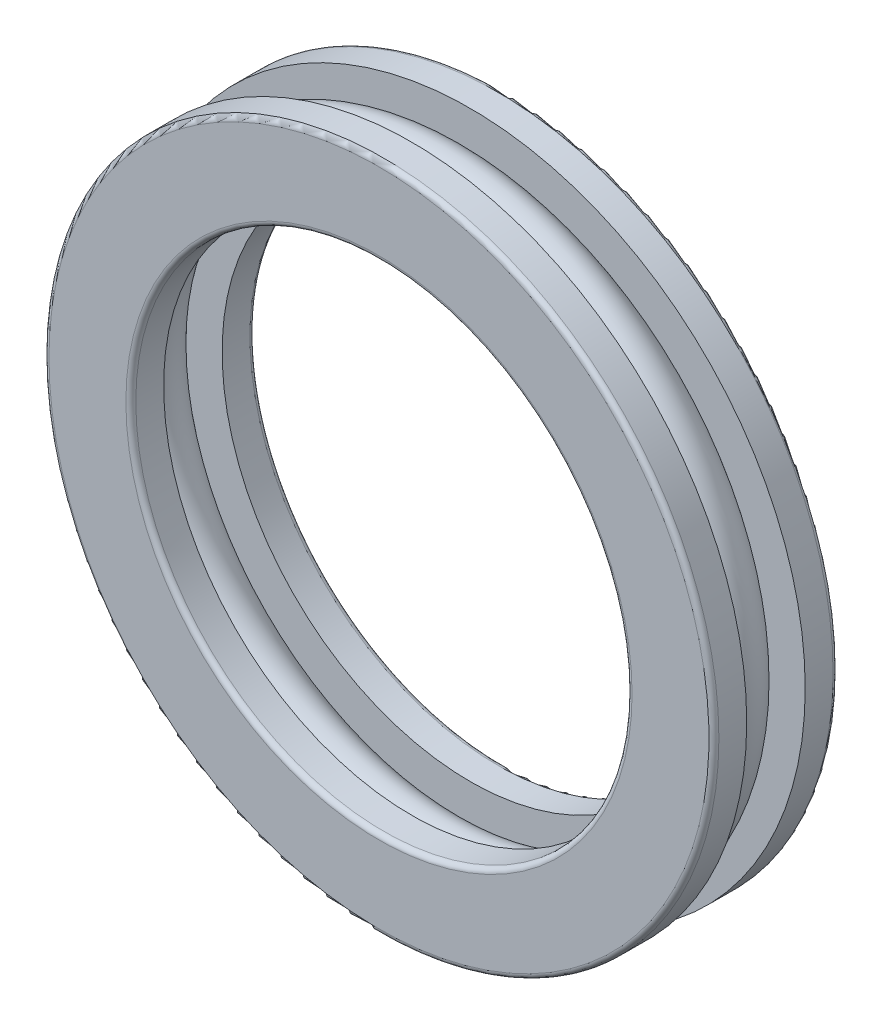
ISO-10303-21;
HEADER;
FILE_DESCRIPTION(('STEP AP214'),'2;1');
FILE_NAME('part.step','',(''),(''),'','','');
FILE_SCHEMA(('AUTOMOTIVE_DESIGN { 1 0 10303 214 1 1 1 1 }'));
ENDSEC;
DATA;
#1=APPLICATION_CONTEXT('core data for automotive mechanical design processes');
#2=APPLICATION_PROTOCOL_DEFINITION('international standard','automotive_design',2000,#1);
#3=PRODUCT_CONTEXT('',#1,'mechanical');
#4=PRODUCT('Part','Part','',(#3));
#5=PRODUCT_RELATED_PRODUCT_CATEGORY('part','',(#4));
#6=PRODUCT_DEFINITION_FORMATION('','',#4);
#7=PRODUCT_DEFINITION_CONTEXT('part definition',#1,'design');
#8=PRODUCT_DEFINITION('design','',#6,#7);
#9=PRODUCT_DEFINITION_SHAPE('','',#8);
#10=(LENGTH_UNIT() NAMED_UNIT(*) SI_UNIT(.MILLI.,.METRE.));
#11=(NAMED_UNIT(*) PLANE_ANGLE_UNIT() SI_UNIT($,.RADIAN.));
#12=(NAMED_UNIT(*) SI_UNIT($,.STERADIAN.) SOLID_ANGLE_UNIT());
#13=UNCERTAINTY_MEASURE_WITH_UNIT(LENGTH_MEASURE(1.E-05),#10,'distance_accuracy_value','');
#14=(GEOMETRIC_REPRESENTATION_CONTEXT(3) GLOBAL_UNCERTAINTY_ASSIGNED_CONTEXT((#13)) GLOBAL_UNIT_ASSIGNED_CONTEXT((#10,
#11,#12)) REPRESENTATION_CONTEXT('',''));
#15=CARTESIAN_POINT('',(0.,0.,0.));
#16=DIRECTION('',(0.,0.,1.));
#17=DIRECTION('',(1.,0.,0.));
#18=AXIS2_PLACEMENT_3D('',#15,#16,#17);
#19=CARTESIAN_POINT('',(0.,0.,-12.5));
#20=DIRECTION('',(0.,0.,1.));
#21=DIRECTION('',(1.,0.,0.));
#22=AXIS2_PLACEMENT_3D('',#19,#20,#21);
#23=TOROIDAL_SURFACE('',#22,58.75,5.2026017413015);
#24=CARTESIAN_POINT('',(63.9526017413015,0.,-12.5));
#25=VERTEX_POINT('',#24);
#26=VERTEX_LOOP('',#25);
#27=FACE_BOUND('',#26,.T.);
#28=ADVANCED_FACE('F39',(#27),#23,.T.);
#29=CLOSED_SHELL('',(#28));
#30=MANIFOLD_SOLID_BREP('B2',#29);
#31=CARTESIAN_POINT('',(0.,0.,0.));
#32=DIRECTION('',(0.,0.,1.));
#33=DIRECTION('',(1.,0.,0.));
#34=AXIS2_PLACEMENT_3D('',#31,#32,#33);
#35=CYLINDRICAL_SURFACE('',#34,67.5);
#36=CARTESIAN_POINT('',(0.,0.,-24.));
#37=DIRECTION('',(0.,0.,1.));
#38=DIRECTION('',(1.,0.,0.));
#39=AXIS2_PLACEMENT_3D('',#36,#37,#38);
#40=CIRCLE('',#39,67.5);
#41=CARTESIAN_POINT('',(67.5,0.,-24.));
#42=VERTEX_POINT('',#41);
#43=EDGE_CURVE('E38',#42,#42,#40,.T.);
#44=ORIENTED_EDGE('',*,*,#43,.T.);
#45=EDGE_LOOP('',(#44));
#46=FACE_BOUND('',#45,.T.);
#47=CARTESIAN_POINT('',(0.,0.,-18.3934339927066));
#48=DIRECTION('',(0.,0.,1.));
#49=DIRECTION('',(1.,0.,0.));
#50=AXIS2_PLACEMENT_3D('',#47,#48,#49);
#51=CIRCLE('',#50,67.5);
#52=CARTESIAN_POINT('',(67.5,0.,-18.3934339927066));
#53=VERTEX_POINT('',#52);
#54=EDGE_CURVE('E78',#53,#53,#51,.T.);
#55=ORIENTED_EDGE('',*,*,#54,.F.);
#56=EDGE_LOOP('',(#55));
#57=FACE_BOUND('',#56,.T.);
#58=ADVANCED_FACE('F58',(#46,#57),#35,.T.);
#59=CARTESIAN_POINT('',(-67.5,0.,-18.3934339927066));
#60=DIRECTION('',(0.,0.,-1.));
#61=DIRECTION('',(-1.,0.,0.));
#62=AXIS2_PLACEMENT_3D('',#59,#60,#61);
#63=PLANE('',#62);
#64=CARTESIAN_POINT('',(0.,0.,-18.3934339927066));
#65=DIRECTION('',(0.,0.,1.));
#66=DIRECTION('',(1.,0.,0.));
#67=AXIS2_PLACEMENT_3D('',#64,#65,#66);
#68=CIRCLE('',#67,50.);
#69=CARTESIAN_POINT('',(50.,0.,-18.3934339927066));
#70=VERTEX_POINT('',#69);
#71=EDGE_CURVE('E81',#70,#70,#68,.T.);
#72=ORIENTED_EDGE('',*,*,#71,.F.);
#73=EDGE_LOOP('',(#72));
#74=FACE_BOUND('',#73,.T.);
#75=ORIENTED_EDGE('',*,*,#54,.T.);
#76=EDGE_LOOP('',(#75));
#77=FACE_BOUND('',#76,.T.);
#78=ADVANCED_FACE('F87',(#74,#77),#63,.F.);
#79=CARTESIAN_POINT('',(0.,0.,0.));
#80=DIRECTION('',(0.,0.,1.));
#81=DIRECTION('',(1.,0.,0.));
#82=AXIS2_PLACEMENT_3D('',#79,#80,#81);
#83=CYLINDRICAL_SURFACE('',#82,50.);
#84=CARTESIAN_POINT('',(0.,0.,-24.));
#85=DIRECTION('',(0.,0.,1.));
#86=DIRECTION('',(1.,0.,0.));
#87=AXIS2_PLACEMENT_3D('',#84,#85,#86);
#88=CIRCLE('',#87,50.);
#89=CARTESIAN_POINT('',(50.,0.,-24.));
#90=VERTEX_POINT('',#89);
#91=EDGE_CURVE('E65',#90,#90,#88,.F.);
#92=ORIENTED_EDGE('',*,*,#91,.T.);
#93=EDGE_LOOP('',(#92));
#94=FACE_BOUND('',#93,.T.);
#95=ORIENTED_EDGE('',*,*,#71,.T.);
#96=EDGE_LOOP('',(#95));
#97=FACE_BOUND('',#96,.T.);
#98=ADVANCED_FACE('F85',(#94,#97),#83,.F.);
#99=CARTESIAN_POINT('',(-67.5,0.,-25.));
#100=DIRECTION('',(0.,0.,1.));
#101=DIRECTION('',(1.,0.,0.));
#102=AXIS2_PLACEMENT_3D('',#99,#100,#101);
#103=PLANE('',#102);
#104=CARTESIAN_POINT('',(0.,0.,-25.));
#105=DIRECTION('',(0.,0.,1.));
#106=DIRECTION('',(1.,0.,0.));
#107=AXIS2_PLACEMENT_3D('',#104,#105,#106);
#108=CIRCLE('',#107,51.);
#109=CARTESIAN_POINT('',(51.,0.,-25.));
#110=VERTEX_POINT('',#109);
#111=EDGE_CURVE('E69',#110,#110,#108,.T.);
#112=ORIENTED_EDGE('',*,*,#111,.T.);
#113=EDGE_LOOP('',(#112));
#114=FACE_BOUND('',#113,.T.);
#115=CARTESIAN_POINT('',(0.,0.,-25.));
#116=DIRECTION('',(0.,0.,1.));
#117=DIRECTION('',(1.,0.,0.));
#118=AXIS2_PLACEMENT_3D('',#115,#116,#117);
#119=CIRCLE('',#118,66.5);
#120=CARTESIAN_POINT('',(66.5,0.,-25.));
#121=VERTEX_POINT('',#120);
#122=EDGE_CURVE('E73',#121,#121,#119,.F.);
#123=ORIENTED_EDGE('',*,*,#122,.T.);
#124=EDGE_LOOP('',(#123));
#125=FACE_BOUND('',#124,.T.);
#126=ADVANCED_FACE('F100',(#114,#125),#103,.F.);
#127=CARTESIAN_POINT('',(0.,0.,-24.));
#128=DIRECTION('',(0.,0.,1.));
#129=DIRECTION('',(1.,0.,0.));
#130=AXIS2_PLACEMENT_3D('',#127,#128,#129);
#131=TOROIDAL_SURFACE('',#130,51.,1.);
#132=ORIENTED_EDGE('',*,*,#91,.F.);
#133=EDGE_LOOP('',(#132));
#134=FACE_BOUND('',#133,.T.);
#135=ORIENTED_EDGE('',*,*,#111,.F.);
#136=EDGE_LOOP('',(#135));
#137=FACE_BOUND('',#136,.T.);
#138=ADVANCED_FACE('F98',(#134,#137),#131,.T.);
#139=CARTESIAN_POINT('',(0.,0.,-24.));
#140=DIRECTION('',(0.,0.,1.));
#141=DIRECTION('',(1.,0.,0.));
#142=AXIS2_PLACEMENT_3D('',#139,#140,#141);
#143=TOROIDAL_SURFACE('',#142,66.5,1.);
#144=ORIENTED_EDGE('',*,*,#122,.F.);
#145=EDGE_LOOP('',(#144));
#146=FACE_BOUND('',#145,.T.);
#147=ORIENTED_EDGE('',*,*,#43,.F.);
#148=EDGE_LOOP('',(#147));
#149=FACE_BOUND('',#148,.T.);
#150=ADVANCED_FACE('F60',(#146,#149),#143,.T.);
#151=CLOSED_SHELL('',(#58,#78,#98,#126,#138,#150));
#152=MANIFOLD_SOLID_BREP('B6',#151);
#153=CARTESIAN_POINT('',(0.,0.,0.));
#154=DIRECTION('',(0.,0.,1.));
#155=DIRECTION('',(1.,0.,0.));
#156=AXIS2_PLACEMENT_3D('',#153,#154,#155);
#157=CYLINDRICAL_SURFACE('',#156,67.5);
#158=CARTESIAN_POINT('',(0.,0.,-1.));
#159=DIRECTION('',(0.,0.,-1.));
#160=DIRECTION('',(-1.,0.,0.));
#161=AXIS2_PLACEMENT_3D('',#158,#159,#160);
#162=CIRCLE('',#161,67.5);
#163=CARTESIAN_POINT('',(-67.5,0.,-1.));
#164=VERTEX_POINT('',#163);
#165=EDGE_CURVE('E156',#164,#164,#162,.T.);
#166=ORIENTED_EDGE('',*,*,#165,.T.);
#167=EDGE_LOOP('',(#166));
#168=FACE_BOUND('',#167,.T.);
#169=CARTESIAN_POINT('',(0.,0.,-6.60656600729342));
#170=DIRECTION('',(0.,0.,1.));
#171=DIRECTION('',(1.,0.,0.));
#172=AXIS2_PLACEMENT_3D('',#169,#170,#171);
#173=CIRCLE('',#172,67.5);
#174=CARTESIAN_POINT('',(67.5,0.,-6.60656600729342));
#175=VERTEX_POINT('',#174);
#176=EDGE_CURVE('E169',#175,#175,#173,.T.);
#177=ORIENTED_EDGE('',*,*,#176,.T.);
#178=EDGE_LOOP('',(#177));
#179=FACE_BOUND('',#178,.T.);
#180=ADVANCED_FACE('F149',(#168,#179),#157,.T.);
#181=CARTESIAN_POINT('',(-67.5,0.,-6.60656600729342));
#182=DIRECTION('',(0.,0.,1.));
#183=DIRECTION('',(1.,0.,0.));
#184=AXIS2_PLACEMENT_3D('',#181,#182,#183);
#185=PLANE('',#184);
#186=ORIENTED_EDGE('',*,*,#176,.F.);
#187=EDGE_LOOP('',(#186));
#188=FACE_BOUND('',#187,.T.);
#189=CARTESIAN_POINT('',(0.,0.,-6.60656600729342));
#190=DIRECTION('',(0.,0.,1.));
#191=DIRECTION('',(1.,0.,0.));
#192=AXIS2_PLACEMENT_3D('',#189,#190,#191);
#193=CIRCLE('',#192,50.);
#194=CARTESIAN_POINT('',(50.,0.,-6.60656600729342));
#195=VERTEX_POINT('',#194);
#196=EDGE_CURVE('E172',#195,#195,#193,.T.);
#197=ORIENTED_EDGE('',*,*,#196,.T.);
#198=EDGE_LOOP('',(#197));
#199=FACE_BOUND('',#198,.T.);
#200=ADVANCED_FACE('F176',(#188,#199),#185,.F.);
#201=CARTESIAN_POINT('',(0.,0.,0.));
#202=DIRECTION('',(0.,0.,1.));
#203=DIRECTION('',(1.,0.,0.));
#204=AXIS2_PLACEMENT_3D('',#201,#202,#203);
#205=CYLINDRICAL_SURFACE('',#204,50.);
#206=CARTESIAN_POINT('',(0.,0.,-1.));
#207=DIRECTION('',(0.,0.,-1.));
#208=DIRECTION('',(-1.,0.,0.));
#209=AXIS2_PLACEMENT_3D('',#206,#207,#208);
#210=CIRCLE('',#209,50.);
#211=CARTESIAN_POINT('',(-50.,0.,-1.));
#212=VERTEX_POINT('',#211);
#213=EDGE_CURVE('E57',#212,#212,#210,.F.);
#214=ORIENTED_EDGE('',*,*,#213,.T.);
#215=EDGE_LOOP('',(#214));
#216=FACE_BOUND('',#215,.T.);
#217=ORIENTED_EDGE('',*,*,#196,.F.);
#218=EDGE_LOOP('',(#217));
#219=FACE_BOUND('',#218,.T.);
#220=ADVANCED_FACE('F178',(#216,#219),#205,.F.);
#221=CARTESIAN_POINT('',(-67.5,0.,0.));
#222=DIRECTION('',(0.,0.,-1.));
#223=DIRECTION('',(-1.,0.,0.));
#224=AXIS2_PLACEMENT_3D('',#221,#222,#223);
#225=PLANE('',#224);
#226=CARTESIAN_POINT('',(0.,0.,0.));
#227=DIRECTION('',(0.,0.,-1.));
#228=DIRECTION('',(-1.,0.,0.));
#229=AXIS2_PLACEMENT_3D('',#226,#227,#228);
#230=CIRCLE('',#229,66.5);
#231=CARTESIAN_POINT('',(-66.5,0.,0.));
#232=VERTEX_POINT('',#231);
#233=EDGE_CURVE('E160',#232,#232,#230,.F.);
#234=ORIENTED_EDGE('',*,*,#233,.T.);
#235=EDGE_LOOP('',(#234));
#236=FACE_BOUND('',#235,.T.);
#237=CARTESIAN_POINT('',(0.,0.,0.));
#238=DIRECTION('',(0.,0.,-1.));
#239=DIRECTION('',(-1.,0.,0.));
#240=AXIS2_PLACEMENT_3D('',#237,#238,#239);
#241=CIRCLE('',#240,51.);
#242=CARTESIAN_POINT('',(-51.,0.,0.));
#243=VERTEX_POINT('',#242);
#244=EDGE_CURVE('E164',#243,#243,#241,.T.);
#245=ORIENTED_EDGE('',*,*,#244,.T.);
#246=EDGE_LOOP('',(#245));
#247=FACE_BOUND('',#246,.T.);
#248=ADVANCED_FACE('F180',(#236,#247),#225,.F.);
#249=CARTESIAN_POINT('',(0.,0.,-1.));
#250=DIRECTION('',(0.,0.,-1.));
#251=DIRECTION('',(-1.,0.,0.));
#252=AXIS2_PLACEMENT_3D('',#249,#250,#251);
#253=TOROIDAL_SURFACE('',#252,66.5,1.);
#254=ORIENTED_EDGE('',*,*,#165,.F.);
#255=EDGE_LOOP('',(#254));
#256=FACE_BOUND('',#255,.T.);
#257=ORIENTED_EDGE('',*,*,#233,.F.);
#258=EDGE_LOOP('',(#257));
#259=FACE_BOUND('',#258,.T.);
#260=ADVANCED_FACE('F186',(#256,#259),#253,.T.);
#261=CARTESIAN_POINT('',(0.,0.,-1.));
#262=DIRECTION('',(0.,0.,-1.));
#263=DIRECTION('',(-1.,0.,0.));
#264=AXIS2_PLACEMENT_3D('',#261,#262,#263);
#265=TOROIDAL_SURFACE('',#264,51.,1.);
#266=ORIENTED_EDGE('',*,*,#244,.F.);
#267=EDGE_LOOP('',(#266));
#268=FACE_BOUND('',#267,.T.);
#269=ORIENTED_EDGE('',*,*,#213,.F.);
#270=EDGE_LOOP('',(#269));
#271=FACE_BOUND('',#270,.T.);
#272=ADVANCED_FACE('F151',(#268,#271),#265,.T.);
#273=CLOSED_SHELL('',(#180,#200,#220,#248,#260,#272));
#274=MANIFOLD_SOLID_BREP('B33',#273);
#275=ADVANCED_BREP_SHAPE_REPRESENTATION('',(#18,#30,#152,#274),#14);
#276=SHAPE_DEFINITION_REPRESENTATION(#9,#275);
ENDSEC;
END-ISO-10303-21;
